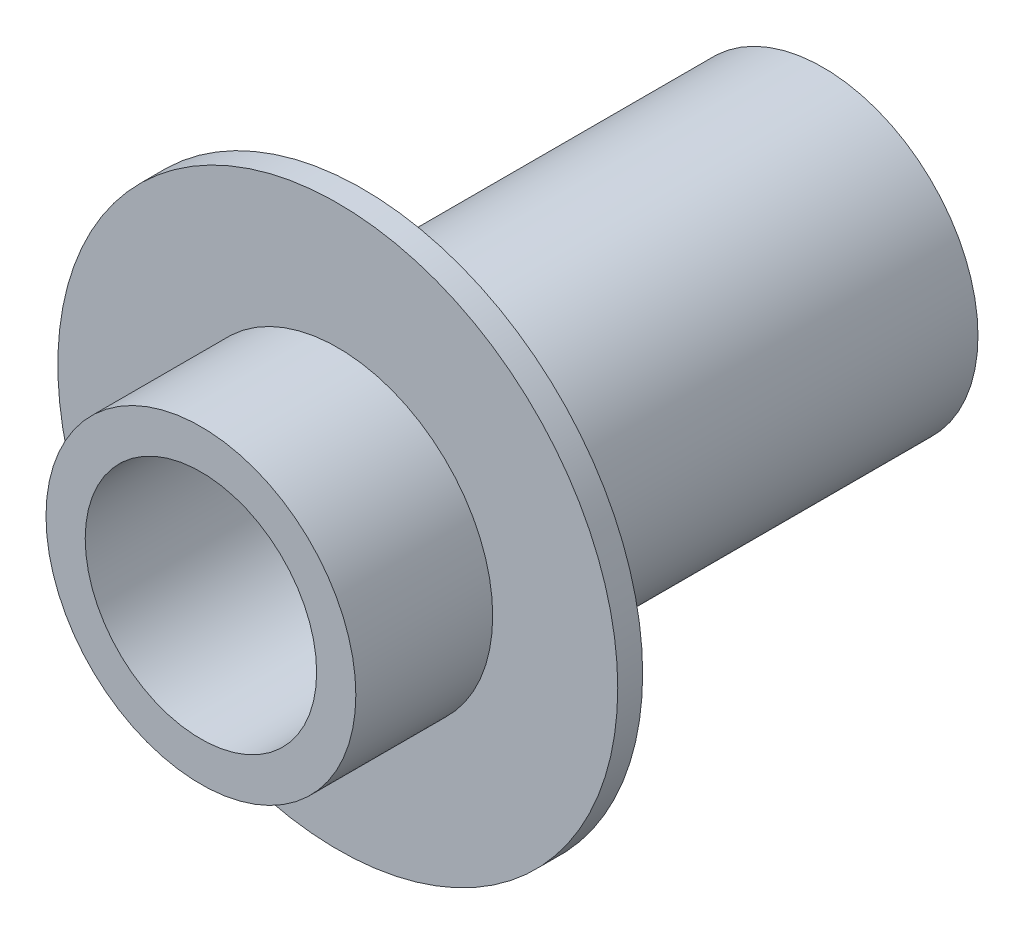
ISO-10303-21;
HEADER;
FILE_DESCRIPTION(('STEP AP214'),'2;1');
FILE_NAME('part.step','',(''),(''),'','','');
FILE_SCHEMA(('AUTOMOTIVE_DESIGN { 1 0 10303 214 1 1 1 1 }'));
ENDSEC;
DATA;
#1=APPLICATION_CONTEXT('core data for automotive mechanical design processes');
#2=APPLICATION_PROTOCOL_DEFINITION('international standard','automotive_design',2000,#1);
#3=PRODUCT_CONTEXT('',#1,'mechanical');
#4=PRODUCT('Part','Part','',(#3));
#5=PRODUCT_RELATED_PRODUCT_CATEGORY('part','',(#4));
#6=PRODUCT_DEFINITION_FORMATION('','',#4);
#7=PRODUCT_DEFINITION_CONTEXT('part definition',#1,'design');
#8=PRODUCT_DEFINITION('design','',#6,#7);
#9=PRODUCT_DEFINITION_SHAPE('','',#8);
#10=(LENGTH_UNIT() NAMED_UNIT(*) SI_UNIT(.MILLI.,.METRE.));
#11=(NAMED_UNIT(*) PLANE_ANGLE_UNIT() SI_UNIT($,.RADIAN.));
#12=(NAMED_UNIT(*) SI_UNIT($,.STERADIAN.) SOLID_ANGLE_UNIT());
#13=UNCERTAINTY_MEASURE_WITH_UNIT(LENGTH_MEASURE(1.E-05),#10,'distance_accuracy_value','');
#14=(GEOMETRIC_REPRESENTATION_CONTEXT(3) GLOBAL_UNCERTAINTY_ASSIGNED_CONTEXT((#13)) GLOBAL_UNIT_ASSIGNED_CONTEXT((#10,
#11,#12)) REPRESENTATION_CONTEXT('',''));
#15=CARTESIAN_POINT('',(0.,0.,0.));
#16=DIRECTION('',(0.,0.,1.));
#17=DIRECTION('',(1.,0.,0.));
#18=AXIS2_PLACEMENT_3D('',#15,#16,#17);
#19=CARTESIAN_POINT('',(0.,0.,0.));
#20=DIRECTION('',(0.,0.,1.));
#21=DIRECTION('',(1.,0.,0.));
#22=AXIS2_PLACEMENT_3D('',#19,#20,#21);
#23=PLANE('',#22);
#24=CARTESIAN_POINT('',(0.,0.,0.));
#25=DIRECTION('',(0.,0.,1.));
#26=DIRECTION('',(1.,0.,0.));
#27=AXIS2_PLACEMENT_3D('',#24,#25,#26);
#28=CIRCLE('',#27,3.1623);
#29=CARTESIAN_POINT('',(3.1623,0.,0.));
#30=VERTEX_POINT('',#29);
#31=EDGE_CURVE('E41',#30,#30,#28,.T.);
#32=ORIENTED_EDGE('',*,*,#31,.F.);
#33=EDGE_LOOP('',(#32));
#34=FACE_BOUND('',#33,.T.);
#35=CARTESIAN_POINT('',(0.,0.,0.));
#36=DIRECTION('',(0.,0.,1.));
#37=DIRECTION('',(1.,0.,0.));
#38=AXIS2_PLACEMENT_3D('',#35,#36,#37);
#39=CIRCLE('',#38,2.3622);
#40=CARTESIAN_POINT('',(2.3622,0.,0.));
#41=VERTEX_POINT('',#40);
#42=EDGE_CURVE('E45',#41,#41,#39,.T.);
#43=ORIENTED_EDGE('',*,*,#42,.T.);
#44=EDGE_LOOP('',(#43));
#45=FACE_BOUND('',#44,.T.);
#46=ADVANCED_FACE('F30',(#34,#45),#23,.F.);
#47=CARTESIAN_POINT('',(0.,0.,9.398));
#48=DIRECTION('',(0.,0.,-1.));
#49=DIRECTION('',(-1.,0.,0.));
#50=AXIS2_PLACEMENT_3D('',#47,#48,#49);
#51=CYLINDRICAL_SURFACE('',#50,3.1623);
#52=CARTESIAN_POINT('',(0.,0.,9.398));
#53=DIRECTION('',(0.,0.,1.));
#54=DIRECTION('',(1.,0.,0.));
#55=AXIS2_PLACEMENT_3D('',#52,#53,#54);
#56=CIRCLE('',#55,3.1623);
#57=CARTESIAN_POINT('',(3.1623,0.,9.398));
#58=VERTEX_POINT('',#57);
#59=EDGE_CURVE('E37',#58,#58,#56,.T.);
#60=ORIENTED_EDGE('',*,*,#59,.F.);
#61=EDGE_LOOP('',(#60));
#62=FACE_BOUND('',#61,.T.);
#63=ORIENTED_EDGE('',*,*,#31,.T.);
#64=EDGE_LOOP('',(#63));
#65=FACE_BOUND('',#64,.T.);
#66=ADVANCED_FACE('F32',(#62,#65),#51,.T.);
#67=CARTESIAN_POINT('',(0.,0.,9.398));
#68=DIRECTION('',(0.,0.,-1.));
#69=DIRECTION('',(-1.,0.,0.));
#70=AXIS2_PLACEMENT_3D('',#67,#68,#69);
#71=CYLINDRICAL_SURFACE('',#70,2.3622);
#72=ORIENTED_EDGE('',*,*,#42,.F.);
#73=EDGE_LOOP('',(#72));
#74=FACE_BOUND('',#73,.T.);
#75=CARTESIAN_POINT('',(0.,0.,12.7));
#76=DIRECTION('',(0.,0.,-1.));
#77=DIRECTION('',(-1.,0.,0.));
#78=AXIS2_PLACEMENT_3D('',#75,#76,#77);
#79=CIRCLE('',#78,2.3622);
#80=CARTESIAN_POINT('',(-2.3622,0.,12.7));
#81=VERTEX_POINT('',#80);
#82=EDGE_CURVE('E59',#81,#81,#79,.T.);
#83=ORIENTED_EDGE('',*,*,#82,.F.);
#84=EDGE_LOOP('',(#83));
#85=FACE_BOUND('',#84,.T.);
#86=ADVANCED_FACE('F66',(#74,#85),#71,.F.);
#87=CARTESIAN_POINT('',(0.,0.,9.398));
#88=DIRECTION('',(0.,0.,1.));
#89=DIRECTION('',(1.,0.,0.));
#90=AXIS2_PLACEMENT_3D('',#87,#88,#89);
#91=PLANE('',#90);
#92=CARTESIAN_POINT('',(0.,0.,9.398));
#93=DIRECTION('',(0.,0.,1.));
#94=DIRECTION('',(1.,0.,0.));
#95=AXIS2_PLACEMENT_3D('',#92,#93,#94);
#96=CIRCLE('',#95,5.715);
#97=CARTESIAN_POINT('',(5.715,0.,9.398));
#98=VERTEX_POINT('',#97);
#99=EDGE_CURVE('E53',#98,#98,#96,.T.);
#100=ORIENTED_EDGE('',*,*,#99,.F.);
#101=EDGE_LOOP('',(#100));
#102=FACE_BOUND('',#101,.T.);
#103=ORIENTED_EDGE('',*,*,#59,.T.);
#104=EDGE_LOOP('',(#103));
#105=FACE_BOUND('',#104,.T.);
#106=ADVANCED_FACE('F68',(#102,#105),#91,.F.);
#107=CARTESIAN_POINT('',(0.,0.,9.906));
#108=DIRECTION('',(0.,0.,1.));
#109=DIRECTION('',(1.,0.,0.));
#110=AXIS2_PLACEMENT_3D('',#107,#108,#109);
#111=PLANE('',#110);
#112=CARTESIAN_POINT('',(0.,0.,9.906));
#113=DIRECTION('',(0.,0.,1.));
#114=DIRECTION('',(1.,0.,0.));
#115=AXIS2_PLACEMENT_3D('',#112,#113,#114);
#116=CIRCLE('',#115,3.1623);
#117=CARTESIAN_POINT('',(-3.1623,0.,9.906));
#118=VERTEX_POINT('',#117);
#119=EDGE_CURVE('E10',#118,#118,#116,.T.);
#120=ORIENTED_EDGE('',*,*,#119,.F.);
#121=EDGE_LOOP('',(#120));
#122=FACE_BOUND('',#121,.T.);
#123=CARTESIAN_POINT('',(0.,0.,9.906));
#124=DIRECTION('',(0.,0.,1.));
#125=DIRECTION('',(1.,0.,0.));
#126=AXIS2_PLACEMENT_3D('',#123,#124,#125);
#127=CIRCLE('',#126,5.715);
#128=CARTESIAN_POINT('',(5.715,0.,9.906));
#129=VERTEX_POINT('',#128);
#130=EDGE_CURVE('E50',#129,#129,#127,.T.);
#131=ORIENTED_EDGE('',*,*,#130,.T.);
#132=EDGE_LOOP('',(#131));
#133=FACE_BOUND('',#132,.T.);
#134=ADVANCED_FACE('F75',(#122,#133),#111,.T.);
#135=CARTESIAN_POINT('',(0.,0.,9.906));
#136=DIRECTION('',(0.,0.,-1.));
#137=DIRECTION('',(-1.,0.,0.));
#138=AXIS2_PLACEMENT_3D('',#135,#136,#137);
#139=CYLINDRICAL_SURFACE('',#138,5.715);
#140=ORIENTED_EDGE('',*,*,#130,.F.);
#141=EDGE_LOOP('',(#140));
#142=FACE_BOUND('',#141,.T.);
#143=ORIENTED_EDGE('',*,*,#99,.T.);
#144=EDGE_LOOP('',(#143));
#145=FACE_BOUND('',#144,.T.);
#146=ADVANCED_FACE('F115',(#142,#145),#139,.T.);
#147=CARTESIAN_POINT('',(0.,0.,12.7));
#148=DIRECTION('',(0.,0.,-1.));
#149=DIRECTION('',(-1.,0.,0.));
#150=AXIS2_PLACEMENT_3D('',#147,#148,#149);
#151=CYLINDRICAL_SURFACE('',#150,3.1623);
#152=CARTESIAN_POINT('',(0.,0.,12.7));
#153=DIRECTION('',(0.,0.,-1.));
#154=DIRECTION('',(-1.,0.,0.));
#155=AXIS2_PLACEMENT_3D('',#152,#153,#154);
#156=CIRCLE('',#155,3.1623);
#157=CARTESIAN_POINT('',(-3.1623,0.,12.7));
#158=VERTEX_POINT('',#157);
#159=EDGE_CURVE('E56',#158,#158,#156,.T.);
#160=CARTESIAN_POINT('',(-3.1623,0.,9.906));
#161=CARTESIAN_POINT('',(-3.1623,0.,9.93510416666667));
#162=CARTESIAN_POINT('',(-3.1623,0.,9.96420833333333));
#163=CARTESIAN_POINT('',(-3.1623,0.,10.0224166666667));
#164=CARTESIAN_POINT('',(-3.1623,0.,10.0515208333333));
#165=CARTESIAN_POINT('',(-3.1623,0.,10.1097291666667));
#166=CARTESIAN_POINT('',(-3.1623,0.,10.1388333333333));
#167=CARTESIAN_POINT('',(-3.1623,0.,10.1970416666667));
#168=CARTESIAN_POINT('',(-3.1623,0.,10.2261458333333));
#169=CARTESIAN_POINT('',(-3.1623,0.,10.2843541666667));
#170=CARTESIAN_POINT('',(-3.1623,0.,10.3134583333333));
#171=CARTESIAN_POINT('',(-3.1623,0.,10.3716666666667));
#172=CARTESIAN_POINT('',(-3.1623,0.,10.4007708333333));
#173=CARTESIAN_POINT('',(-3.1623,0.,10.4589791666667));
#174=CARTESIAN_POINT('',(-3.1623,0.,10.4880833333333));
#175=CARTESIAN_POINT('',(-3.1623,0.,10.5462916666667));
#176=CARTESIAN_POINT('',(-3.1623,0.,10.5753958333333));
#177=CARTESIAN_POINT('',(-3.1623,0.,10.6336041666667));
#178=CARTESIAN_POINT('',(-3.1623,0.,10.6627083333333));
#179=CARTESIAN_POINT('',(-3.1623,0.,10.7209166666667));
#180=CARTESIAN_POINT('',(-3.1623,0.,10.7500208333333));
#181=CARTESIAN_POINT('',(-3.1623,0.,10.8082291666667));
#182=CARTESIAN_POINT('',(-3.1623,0.,10.8373333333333));
#183=CARTESIAN_POINT('',(-3.1623,0.,10.8955416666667));
#184=CARTESIAN_POINT('',(-3.1623,0.,10.9246458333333));
#185=CARTESIAN_POINT('',(-3.1623,0.,10.9828541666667));
#186=CARTESIAN_POINT('',(-3.1623,0.,11.0119583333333));
#187=CARTESIAN_POINT('',(-3.1623,0.,11.0701666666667));
#188=CARTESIAN_POINT('',(-3.1623,0.,11.0992708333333));
#189=CARTESIAN_POINT('',(-3.1623,0.,11.1574791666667));
#190=CARTESIAN_POINT('',(-3.1623,0.,11.1865833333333));
#191=CARTESIAN_POINT('',(-3.1623,0.,11.2447916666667));
#192=CARTESIAN_POINT('',(-3.1623,0.,11.2738958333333));
#193=CARTESIAN_POINT('',(-3.1623,0.,11.3321041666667));
#194=CARTESIAN_POINT('',(-3.1623,0.,11.3612083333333));
#195=CARTESIAN_POINT('',(-3.1623,0.,11.4194166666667));
#196=CARTESIAN_POINT('',(-3.1623,0.,11.4485208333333));
#197=CARTESIAN_POINT('',(-3.1623,0.,11.5067291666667));
#198=CARTESIAN_POINT('',(-3.1623,0.,11.5358333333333));
#199=CARTESIAN_POINT('',(-3.1623,0.,11.5940416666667));
#200=CARTESIAN_POINT('',(-3.1623,0.,11.6231458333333));
#201=CARTESIAN_POINT('',(-3.1623,0.,11.6813541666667));
#202=CARTESIAN_POINT('',(-3.1623,0.,11.7104583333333));
#203=CARTESIAN_POINT('',(-3.1623,0.,11.7686666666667));
#204=CARTESIAN_POINT('',(-3.1623,0.,11.7977708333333));
#205=CARTESIAN_POINT('',(-3.1623,0.,11.8559791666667));
#206=CARTESIAN_POINT('',(-3.1623,0.,11.8850833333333));
#207=CARTESIAN_POINT('',(-3.1623,0.,11.9432916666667));
#208=CARTESIAN_POINT('',(-3.1623,0.,11.9723958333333));
#209=CARTESIAN_POINT('',(-3.1623,0.,12.0306041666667));
#210=CARTESIAN_POINT('',(-3.1623,0.,12.0597083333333));
#211=CARTESIAN_POINT('',(-3.1623,0.,12.1179166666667));
#212=CARTESIAN_POINT('',(-3.1623,0.,12.1470208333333));
#213=CARTESIAN_POINT('',(-3.1623,0.,12.2052291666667));
#214=CARTESIAN_POINT('',(-3.1623,0.,12.2343333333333));
#215=CARTESIAN_POINT('',(-3.1623,0.,12.2925416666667));
#216=CARTESIAN_POINT('',(-3.1623,0.,12.3216458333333));
#217=CARTESIAN_POINT('',(-3.1623,0.,12.3798541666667));
#218=CARTESIAN_POINT('',(-3.1623,0.,12.4089583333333));
#219=CARTESIAN_POINT('',(-3.1623,0.,12.4671666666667));
#220=CARTESIAN_POINT('',(-3.1623,0.,12.4962708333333));
#221=CARTESIAN_POINT('',(-3.1623,0.,12.5544791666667));
#222=CARTESIAN_POINT('',(-3.1623,0.,12.5835833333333));
#223=CARTESIAN_POINT('',(-3.1623,0.,12.6417916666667));
#224=CARTESIAN_POINT('',(-3.1623,0.,12.6708958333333));
#225=CARTESIAN_POINT('',(-3.1623,0.,12.7));
#226=B_SPLINE_CURVE_WITH_KNOTS('',3,(#160,#161,#162,#163,#164,#165,#166,#167,#168,#169,#170,
#171,#172,#173,#174,#175,#176,#177,#178,#179,#180,#181,#182,#183,#184,#185,#186,#187,#188,#189,
#190,#191,#192,#193,#194,#195,#196,#197,#198,#199,#200,#201,#202,#203,#204,#205,#206,#207,#208,
#209,#210,#211,#212,#213,#214,#215,#216,#217,#218,#219,#220,#221,#222,#223,#224,#225),
.UNSPECIFIED.,.F.,.F.,(4,2,2,2,2,2,2,2,2,2,2,2,2,2,2,2,2,2,2,2,2,2,2,2,2,2,2,2,2,2,2,2,4),(0.,
0.0873125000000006,0.174624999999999,0.2619375,0.349250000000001,0.436562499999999,0.523875,
0.611187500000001,0.698499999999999,0.7858125,0.873125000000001,0.960437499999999,1.04775,
1.1350625,1.222375,1.3096875,1.397,1.4843125,1.571625,1.6589375,1.74625,1.8335625,1.920875,
2.0081875,2.0955,2.1828125,2.270125,2.3574375,2.44475,2.5320625,2.619375,2.7066875,2.794),.UNSPECIFIED.);
#227=EDGE_CURVE('BSEAM124',#118,#158,#226,.T.);
#228=ORIENTED_EDGE('',*,*,#119,.T.);
#229=ORIENTED_EDGE('',*,*,#159,.T.);
#230=ORIENTED_EDGE('',*,*,#227,.T.);
#231=ORIENTED_EDGE('',*,*,#227,.F.);
#232=EDGE_LOOP('',(#228,#230,#229,#231));
#233=FACE_BOUND('',#232,.T.);
#234=ADVANCED_FACE('F124',(#233),#151,.T.);
#235=CARTESIAN_POINT('',(0.,0.,12.7));
#236=DIRECTION('',(0.,0.,-1.));
#237=DIRECTION('',(-1.,0.,0.));
#238=AXIS2_PLACEMENT_3D('',#235,#236,#237);
#239=PLANE('',#238);
#240=ORIENTED_EDGE('',*,*,#82,.T.);
#241=EDGE_LOOP('',(#240));
#242=FACE_BOUND('',#241,.T.);
#243=ORIENTED_EDGE('',*,*,#159,.F.);
#244=EDGE_LOOP('',(#243));
#245=FACE_BOUND('',#244,.T.);
#246=ADVANCED_FACE('F63',(#242,#245),#239,.F.);
#247=CLOSED_SHELL('',(#46,#66,#86,#106,#134,#146,#234,#246));
#248=MANIFOLD_SOLID_BREP('B2',#247);
#249=ADVANCED_BREP_SHAPE_REPRESENTATION('',(#18,#248),#14);
#250=SHAPE_DEFINITION_REPRESENTATION(#9,#249);
ENDSEC;
END-ISO-10303-21;
